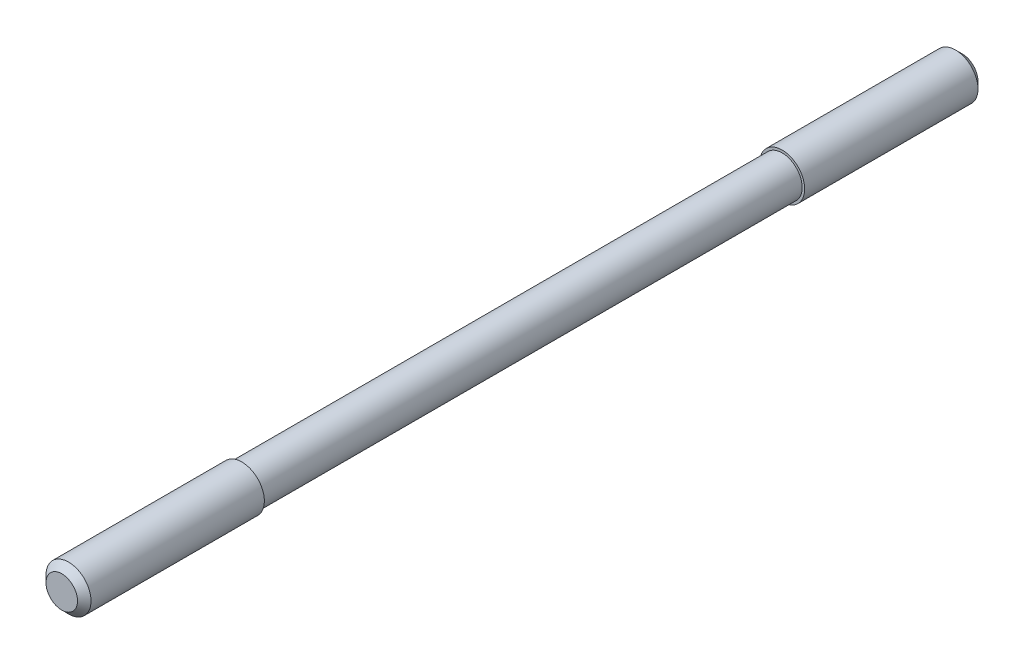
ISO-10303-21;
HEADER;
FILE_DESCRIPTION(('STEP AP214'),'2;1');
FILE_NAME('part.step','',(''),(''),'','','');
FILE_SCHEMA(('AUTOMOTIVE_DESIGN { 1 0 10303 214 1 1 1 1 }'));
ENDSEC;
DATA;
#1=APPLICATION_CONTEXT('core data for automotive mechanical design processes');
#2=APPLICATION_PROTOCOL_DEFINITION('international standard','automotive_design',2000,#1);
#3=PRODUCT_CONTEXT('',#1,'mechanical');
#4=PRODUCT('Part','Part','',(#3));
#5=PRODUCT_RELATED_PRODUCT_CATEGORY('part','',(#4));
#6=PRODUCT_DEFINITION_FORMATION('','',#4);
#7=PRODUCT_DEFINITION_CONTEXT('part definition',#1,'design');
#8=PRODUCT_DEFINITION('design','',#6,#7);
#9=PRODUCT_DEFINITION_SHAPE('','',#8);
#10=(LENGTH_UNIT() NAMED_UNIT(*) SI_UNIT(.MILLI.,.METRE.));
#11=(NAMED_UNIT(*) PLANE_ANGLE_UNIT() SI_UNIT($,.RADIAN.));
#12=(NAMED_UNIT(*) SI_UNIT($,.STERADIAN.) SOLID_ANGLE_UNIT());
#13=UNCERTAINTY_MEASURE_WITH_UNIT(LENGTH_MEASURE(1.E-05),#10,'distance_accuracy_value','');
#14=(GEOMETRIC_REPRESENTATION_CONTEXT(3) GLOBAL_UNCERTAINTY_ASSIGNED_CONTEXT((#13)) GLOBAL_UNIT_ASSIGNED_CONTEXT((#10,
#11,#12)) REPRESENTATION_CONTEXT('',''));
#15=CARTESIAN_POINT('',(0.,0.,0.));
#16=DIRECTION('',(0.,0.,1.));
#17=DIRECTION('',(1.,0.,0.));
#18=AXIS2_PLACEMENT_3D('',#15,#16,#17);
#19=CARTESIAN_POINT('',(0.,0.,0.));
#20=DIRECTION('',(0.,0.,1.));
#21=DIRECTION('',(1.,0.,0.));
#22=AXIS2_PLACEMENT_3D('',#19,#20,#21);
#23=PLANE('',#22);
#24=CARTESIAN_POINT('',(0.,0.,0.));
#25=DIRECTION('',(0.,0.,1.));
#26=DIRECTION('',(1.,0.,0.));
#27=AXIS2_PLACEMENT_3D('',#24,#25,#26);
#28=CIRCLE('',#27,3.5);
#29=CARTESIAN_POINT('',(3.5,0.,0.));
#30=VERTEX_POINT('',#29);
#31=EDGE_CURVE('E8',#30,#30,#28,.T.);
#32=ORIENTED_EDGE('',*,*,#31,.F.);
#33=EDGE_LOOP('',(#32));
#34=FACE_BOUND('',#33,.T.);
#35=ADVANCED_FACE('F12',(#34),#23,.F.);
#36=CARTESIAN_POINT('',(0.,0.,1.5));
#37=DIRECTION('',(0.,0.,1.));
#38=DIRECTION('',(1.,0.,0.));
#39=AXIS2_PLACEMENT_3D('',#36,#37,#38);
#40=CONICAL_SURFACE('',#39,5.,0.785398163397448);
#41=ORIENTED_EDGE('',*,*,#31,.T.);
#42=EDGE_LOOP('',(#41));
#43=FACE_BOUND('',#42,.T.);
#44=CARTESIAN_POINT('',(0.,0.,1.5));
#45=DIRECTION('',(0.,0.,1.));
#46=DIRECTION('',(1.,0.,0.));
#47=AXIS2_PLACEMENT_3D('',#44,#45,#46);
#48=CIRCLE('',#47,5.);
#49=CARTESIAN_POINT('',(5.,0.,1.5));
#50=VERTEX_POINT('',#49);
#51=EDGE_CURVE('E18',#50,#50,#48,.T.);
#52=ORIENTED_EDGE('',*,*,#51,.F.);
#53=EDGE_LOOP('',(#52));
#54=FACE_BOUND('',#53,.T.);
#55=ADVANCED_FACE('F61',(#43,#54),#40,.T.);
#56=CARTESIAN_POINT('',(0.,0.,70.));
#57=DIRECTION('',(0.,0.,1.));
#58=DIRECTION('',(1.,0.,0.));
#59=AXIS2_PLACEMENT_3D('',#56,#57,#58);
#60=CYLINDRICAL_SURFACE('',#59,5.);
#61=CARTESIAN_POINT('',(0.,0.,40.));
#62=DIRECTION('',(0.,0.,1.));
#63=DIRECTION('',(1.,0.,0.));
#64=AXIS2_PLACEMENT_3D('',#61,#62,#63);
#65=CIRCLE('',#64,5.);
#66=CARTESIAN_POINT('',(5.,0.,40.));
#67=VERTEX_POINT('',#66);
#68=EDGE_CURVE('E22',#67,#67,#65,.T.);
#69=ORIENTED_EDGE('',*,*,#68,.F.);
#70=EDGE_LOOP('',(#69));
#71=FACE_BOUND('',#70,.T.);
#72=ORIENTED_EDGE('',*,*,#51,.T.);
#73=EDGE_LOOP('',(#72));
#74=FACE_BOUND('',#73,.T.);
#75=ADVANCED_FACE('F66',(#71,#74),#60,.T.);
#76=CARTESIAN_POINT('',(5.,0.,40.));
#77=DIRECTION('',(0.,0.,-1.));
#78=DIRECTION('',(-1.,0.,0.));
#79=AXIS2_PLACEMENT_3D('',#76,#77,#78);
#80=PLANE('',#79);
#81=CARTESIAN_POINT('',(0.,0.,40.));
#82=DIRECTION('',(0.,0.,1.));
#83=DIRECTION('',(1.,0.,0.));
#84=AXIS2_PLACEMENT_3D('',#81,#82,#83);
#85=CIRCLE('',#84,4.45);
#86=CARTESIAN_POINT('',(4.45,0.,40.));
#87=VERTEX_POINT('',#86);
#88=EDGE_CURVE('E26',#87,#87,#85,.T.);
#89=ORIENTED_EDGE('',*,*,#88,.F.);
#90=EDGE_LOOP('',(#89));
#91=FACE_BOUND('',#90,.T.);
#92=ORIENTED_EDGE('',*,*,#68,.T.);
#93=EDGE_LOOP('',(#92));
#94=FACE_BOUND('',#93,.T.);
#95=ADVANCED_FACE('F70',(#91,#94),#80,.F.);
#96=CARTESIAN_POINT('',(0.,0.,70.));
#97=DIRECTION('',(0.,0.,1.));
#98=DIRECTION('',(1.,0.,0.));
#99=AXIS2_PLACEMENT_3D('',#96,#97,#98);
#100=CYLINDRICAL_SURFACE('',#99,4.45);
#101=CARTESIAN_POINT('',(0.,0.,160.));
#102=DIRECTION('',(0.,0.,1.));
#103=DIRECTION('',(1.,0.,0.));
#104=AXIS2_PLACEMENT_3D('',#101,#102,#103);
#105=CIRCLE('',#104,4.45);
#106=CARTESIAN_POINT('',(4.45,0.,160.));
#107=VERTEX_POINT('',#106);
#108=EDGE_CURVE('E31',#107,#107,#105,.T.);
#109=ORIENTED_EDGE('',*,*,#108,.F.);
#110=EDGE_LOOP('',(#109));
#111=FACE_BOUND('',#110,.T.);
#112=ORIENTED_EDGE('',*,*,#88,.T.);
#113=EDGE_LOOP('',(#112));
#114=FACE_BOUND('',#113,.T.);
#115=ADVANCED_FACE('F77',(#111,#114),#100,.T.);
#116=CARTESIAN_POINT('',(4.45,0.,160.));
#117=DIRECTION('',(0.,0.,1.));
#118=DIRECTION('',(1.,0.,0.));
#119=AXIS2_PLACEMENT_3D('',#116,#117,#118);
#120=PLANE('',#119);
#121=CARTESIAN_POINT('',(0.,0.,160.));
#122=DIRECTION('',(0.,0.,1.));
#123=DIRECTION('',(1.,0.,0.));
#124=AXIS2_PLACEMENT_3D('',#121,#122,#123);
#125=CIRCLE('',#124,5.);
#126=CARTESIAN_POINT('',(5.,0.,160.));
#127=VERTEX_POINT('',#126);
#128=EDGE_CURVE('E34',#127,#127,#125,.T.);
#129=ORIENTED_EDGE('',*,*,#128,.F.);
#130=EDGE_LOOP('',(#129));
#131=FACE_BOUND('',#130,.T.);
#132=ORIENTED_EDGE('',*,*,#108,.T.);
#133=EDGE_LOOP('',(#132));
#134=FACE_BOUND('',#133,.T.);
#135=ADVANCED_FACE('F57',(#131,#134),#120,.F.);
#136=CARTESIAN_POINT('',(0.,0.,70.));
#137=DIRECTION('',(0.,0.,1.));
#138=DIRECTION('',(1.,0.,0.));
#139=AXIS2_PLACEMENT_3D('',#136,#137,#138);
#140=CYLINDRICAL_SURFACE('',#139,5.);
#141=CARTESIAN_POINT('',(0.,0.,198.5));
#142=DIRECTION('',(0.,0.,1.));
#143=DIRECTION('',(1.,0.,0.));
#144=AXIS2_PLACEMENT_3D('',#141,#142,#143);
#145=CIRCLE('',#144,5.);
#146=CARTESIAN_POINT('',(5.,0.,198.5));
#147=VERTEX_POINT('',#146);
#148=EDGE_CURVE('E37',#147,#147,#145,.T.);
#149=ORIENTED_EDGE('',*,*,#148,.F.);
#150=EDGE_LOOP('',(#149));
#151=FACE_BOUND('',#150,.T.);
#152=ORIENTED_EDGE('',*,*,#128,.T.);
#153=EDGE_LOOP('',(#152));
#154=FACE_BOUND('',#153,.T.);
#155=ADVANCED_FACE('F48',(#151,#154),#140,.T.);
#156=CARTESIAN_POINT('',(0.,0.,200.));
#157=DIRECTION('',(0.,0.,-1.));
#158=DIRECTION('',(-1.,0.,0.));
#159=AXIS2_PLACEMENT_3D('',#156,#157,#158);
#160=CONICAL_SURFACE('',#159,3.5,0.785398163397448);
#161=ORIENTED_EDGE('',*,*,#148,.T.);
#162=EDGE_LOOP('',(#161));
#163=FACE_BOUND('',#162,.T.);
#164=CARTESIAN_POINT('',(0.,0.,200.));
#165=DIRECTION('',(0.,0.,1.));
#166=DIRECTION('',(1.,0.,0.));
#167=AXIS2_PLACEMENT_3D('',#164,#165,#166);
#168=CIRCLE('',#167,3.5);
#169=CARTESIAN_POINT('',(3.5,0.,200.));
#170=VERTEX_POINT('',#169);
#171=EDGE_CURVE('E40',#170,#170,#168,.T.);
#172=ORIENTED_EDGE('',*,*,#171,.F.);
#173=EDGE_LOOP('',(#172));
#174=FACE_BOUND('',#173,.T.);
#175=ADVANCED_FACE('F46',(#163,#174),#160,.T.);
#176=CARTESIAN_POINT('',(3.5,0.,200.));
#177=DIRECTION('',(0.,0.,-1.));
#178=DIRECTION('',(-1.,0.,0.));
#179=AXIS2_PLACEMENT_3D('',#176,#177,#178);
#180=PLANE('',#179);
#181=ORIENTED_EDGE('',*,*,#171,.T.);
#182=EDGE_LOOP('',(#181));
#183=FACE_BOUND('',#182,.T.);
#184=ADVANCED_FACE('F44',(#183),#180,.F.);
#185=CLOSED_SHELL('',(#35,#55,#75,#95,#115,#135,#155,#175,#184));
#186=MANIFOLD_SOLID_BREP('B1',#185);
#187=ADVANCED_BREP_SHAPE_REPRESENTATION('',(#18,#186),#14);
#188=SHAPE_DEFINITION_REPRESENTATION(#9,#187);
ENDSEC;
END-ISO-10303-21;
